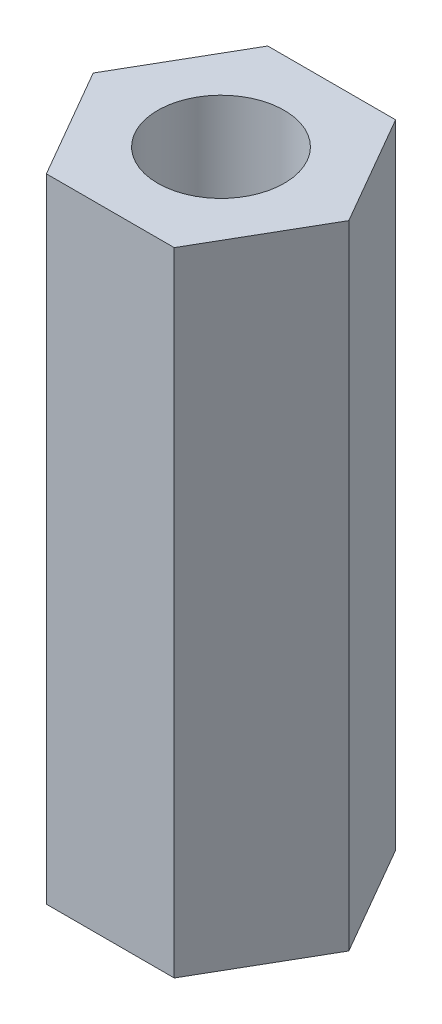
ISO-10303-21;
HEADER;
FILE_DESCRIPTION(('STEP AP214'),'2;1');
FILE_NAME('part.step','',(''),(''),'','','');
FILE_SCHEMA(('AUTOMOTIVE_DESIGN { 1 0 10303 214 1 1 1 1 }'));
ENDSEC;
DATA;
#1=APPLICATION_CONTEXT('core data for automotive mechanical design processes');
#2=APPLICATION_PROTOCOL_DEFINITION('international standard','automotive_design',2000,#1);
#3=PRODUCT_CONTEXT('',#1,'mechanical');
#4=PRODUCT('Part','Part','',(#3));
#5=PRODUCT_RELATED_PRODUCT_CATEGORY('part','',(#4));
#6=PRODUCT_DEFINITION_FORMATION('','',#4);
#7=PRODUCT_DEFINITION_CONTEXT('part definition',#1,'design');
#8=PRODUCT_DEFINITION('design','',#6,#7);
#9=PRODUCT_DEFINITION_SHAPE('','',#8);
#10=(LENGTH_UNIT() NAMED_UNIT(*) SI_UNIT(.MILLI.,.METRE.));
#11=(NAMED_UNIT(*) PLANE_ANGLE_UNIT() SI_UNIT($,.RADIAN.));
#12=(NAMED_UNIT(*) SI_UNIT($,.STERADIAN.) SOLID_ANGLE_UNIT());
#13=UNCERTAINTY_MEASURE_WITH_UNIT(LENGTH_MEASURE(1.E-05),#10,'distance_accuracy_value','');
#14=(GEOMETRIC_REPRESENTATION_CONTEXT(3) GLOBAL_UNCERTAINTY_ASSIGNED_CONTEXT((#13)) GLOBAL_UNIT_ASSIGNED_CONTEXT((#10,
#11,#12)) REPRESENTATION_CONTEXT('',''));
#15=CARTESIAN_POINT('',(0.,0.,0.));
#16=DIRECTION('',(0.,0.,1.));
#17=DIRECTION('',(1.,0.,0.));
#18=AXIS2_PLACEMENT_3D('',#15,#16,#17);
#19=CARTESIAN_POINT('',(0.,20.,0.));
#20=DIRECTION('',(0.,1.,0.));
#21=DIRECTION('',(0.,0.,1.));
#22=AXIS2_PLACEMENT_3D('',#19,#20,#21);
#23=PLANE('',#22);
#24=DIRECTION('',(-0.5,0.,-0.866025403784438));
#25=VECTOR('',#24,1.);
#26=CARTESIAN_POINT('',(4.04145188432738,20.,0.));
#27=LINE('',#26,#25);
#28=CARTESIAN_POINT('',(4.04145188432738,20.,0.));
#29=VERTEX_POINT('',#28);
#30=CARTESIAN_POINT('',(2.02072594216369,20.,-3.5));
#31=VERTEX_POINT('',#30);
#32=EDGE_CURVE('E152',#29,#31,#27,.T.);
#33=ORIENTED_EDGE('',*,*,#32,.T.);
#34=DIRECTION('',(-1.,0.,0.));
#35=VECTOR('',#34,1.);
#36=CARTESIAN_POINT('',(2.02072594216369,20.,-3.5));
#37=LINE('',#36,#35);
#38=CARTESIAN_POINT('',(-2.02072594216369,20.,-3.5));
#39=VERTEX_POINT('',#38);
#40=EDGE_CURVE('E100',#31,#39,#37,.T.);
#41=ORIENTED_EDGE('',*,*,#40,.T.);
#42=DIRECTION('',(-0.5,0.,0.866025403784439));
#43=VECTOR('',#42,1.);
#44=CARTESIAN_POINT('',(-2.02072594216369,20.,-3.5));
#45=LINE('',#44,#43);
#46=CARTESIAN_POINT('',(-4.04145188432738,20.,0.));
#47=VERTEX_POINT('',#46);
#48=EDGE_CURVE('E113',#39,#47,#45,.T.);
#49=ORIENTED_EDGE('',*,*,#48,.T.);
#50=DIRECTION('',(0.5,0.,0.866025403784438));
#51=VECTOR('',#50,1.);
#52=CARTESIAN_POINT('',(-4.04145188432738,20.,0.));
#53=LINE('',#52,#51);
#54=CARTESIAN_POINT('',(-2.02072594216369,20.,3.5));
#55=VERTEX_POINT('',#54);
#56=EDGE_CURVE('E107',#47,#55,#53,.T.);
#57=ORIENTED_EDGE('',*,*,#56,.T.);
#58=DIRECTION('',(1.,0.,0.));
#59=VECTOR('',#58,1.);
#60=CARTESIAN_POINT('',(-2.02072594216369,20.,3.5));
#61=LINE('',#60,#59);
#62=CARTESIAN_POINT('',(2.02072594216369,20.,3.5));
#63=VERTEX_POINT('',#62);
#64=EDGE_CURVE('E111',#55,#63,#61,.T.);
#65=ORIENTED_EDGE('',*,*,#64,.T.);
#66=DIRECTION('',(0.5,0.,-0.866025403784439));
#67=VECTOR('',#66,1.);
#68=CARTESIAN_POINT('',(2.02072594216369,20.,3.5));
#69=LINE('',#68,#67);
#70=EDGE_CURVE('E63',#63,#29,#69,.T.);
#71=ORIENTED_EDGE('',*,*,#70,.T.);
#72=EDGE_LOOP('',(#33,#41,#49,#57,#65,#71));
#73=FACE_BOUND('',#72,.T.);
#74=CARTESIAN_POINT('',(0.,20.,0.));
#75=DIRECTION('',(0.,1.,0.));
#76=DIRECTION('',(0.,0.,1.));
#77=AXIS2_PLACEMENT_3D('',#74,#75,#76);
#78=CIRCLE('',#77,2.);
#79=CARTESIAN_POINT('',(0.,20.,2.));
#80=VERTEX_POINT('',#79);
#81=EDGE_CURVE('E140',#80,#80,#78,.T.);
#82=ORIENTED_EDGE('',*,*,#81,.F.);
#83=EDGE_LOOP('',(#82));
#84=FACE_BOUND('',#83,.T.);
#85=ADVANCED_FACE('F45',(#73,#84),#23,.T.);
#86=CARTESIAN_POINT('',(0.,0.,0.));
#87=DIRECTION('',(0.,1.,0.));
#88=DIRECTION('',(0.,0.,1.));
#89=AXIS2_PLACEMENT_3D('',#86,#87,#88);
#90=PLANE('',#89);
#91=DIRECTION('',(-0.5,0.,-0.866025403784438));
#92=VECTOR('',#91,1.);
#93=CARTESIAN_POINT('',(4.04145188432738,0.,0.));
#94=LINE('',#93,#92);
#95=CARTESIAN_POINT('',(4.04145188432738,0.,0.));
#96=VERTEX_POINT('',#95);
#97=CARTESIAN_POINT('',(2.02072594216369,0.,-3.5));
#98=VERTEX_POINT('',#97);
#99=EDGE_CURVE('E135',#96,#98,#94,.T.);
#100=ORIENTED_EDGE('',*,*,#99,.F.);
#101=DIRECTION('',(0.5,0.,-0.866025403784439));
#102=VECTOR('',#101,1.);
#103=CARTESIAN_POINT('',(2.02072594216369,0.,3.5));
#104=LINE('',#103,#102);
#105=CARTESIAN_POINT('',(2.02072594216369,0.,3.5));
#106=VERTEX_POINT('',#105);
#107=EDGE_CURVE('E92',#106,#96,#104,.T.);
#108=ORIENTED_EDGE('',*,*,#107,.F.);
#109=DIRECTION('',(1.,0.,0.));
#110=VECTOR('',#109,1.);
#111=CARTESIAN_POINT('',(-2.02072594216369,0.,3.5));
#112=LINE('',#111,#110);
#113=CARTESIAN_POINT('',(-2.02072594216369,0.,3.5));
#114=VERTEX_POINT('',#113);
#115=EDGE_CURVE('E86',#114,#106,#112,.T.);
#116=ORIENTED_EDGE('',*,*,#115,.F.);
#117=DIRECTION('',(0.5,0.,0.866025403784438));
#118=VECTOR('',#117,1.);
#119=CARTESIAN_POINT('',(-4.04145188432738,0.,0.));
#120=LINE('',#119,#118);
#121=CARTESIAN_POINT('',(-4.04145188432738,0.,0.));
#122=VERTEX_POINT('',#121);
#123=EDGE_CURVE('E122',#122,#114,#120,.T.);
#124=ORIENTED_EDGE('',*,*,#123,.F.);
#125=DIRECTION('',(-0.5,0.,0.866025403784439));
#126=VECTOR('',#125,1.);
#127=CARTESIAN_POINT('',(-2.02072594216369,0.,-3.5));
#128=LINE('',#127,#126);
#129=CARTESIAN_POINT('',(-2.02072594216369,0.,-3.5));
#130=VERTEX_POINT('',#129);
#131=EDGE_CURVE('E143',#130,#122,#128,.T.);
#132=ORIENTED_EDGE('',*,*,#131,.F.);
#133=DIRECTION('',(-1.,0.,0.));
#134=VECTOR('',#133,1.);
#135=CARTESIAN_POINT('',(2.02072594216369,0.,-3.5));
#136=LINE('',#135,#134);
#137=EDGE_CURVE('E139',#98,#130,#136,.T.);
#138=ORIENTED_EDGE('',*,*,#137,.F.);
#139=EDGE_LOOP('',(#100,#108,#116,#124,#132,#138));
#140=FACE_BOUND('',#139,.T.);
#141=CARTESIAN_POINT('',(0.,0.,0.));
#142=DIRECTION('',(0.,1.,0.));
#143=DIRECTION('',(0.,0.,1.));
#144=AXIS2_PLACEMENT_3D('',#141,#142,#143);
#145=CIRCLE('',#144,2.);
#146=CARTESIAN_POINT('',(0.,0.,2.));
#147=VERTEX_POINT('',#146);
#148=EDGE_CURVE('E249',#147,#147,#145,.T.);
#149=ORIENTED_EDGE('',*,*,#148,.T.);
#150=EDGE_LOOP('',(#149));
#151=FACE_BOUND('',#150,.T.);
#152=ADVANCED_FACE('F165',(#140,#151),#90,.F.);
#153=CARTESIAN_POINT('',(4.04145188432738,20.,0.));
#154=DIRECTION('',(-0.866025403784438,0.,0.5));
#155=DIRECTION('',(0.5,0.,0.866025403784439));
#156=AXIS2_PLACEMENT_3D('',#153,#154,#155);
#157=PLANE('',#156);
#158=ORIENTED_EDGE('',*,*,#99,.T.);
#159=DIRECTION('',(0.,-1.,0.));
#160=VECTOR('',#159,1.);
#161=CARTESIAN_POINT('',(2.02072594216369,20.,-3.5));
#162=LINE('',#161,#160);
#163=EDGE_CURVE('E11',#31,#98,#162,.T.);
#164=ORIENTED_EDGE('',*,*,#163,.F.);
#165=ORIENTED_EDGE('',*,*,#32,.F.);
#166=DIRECTION('',(0.,-1.,0.));
#167=VECTOR('',#166,1.);
#168=CARTESIAN_POINT('',(4.04145188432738,20.,0.));
#169=LINE('',#168,#167);
#170=EDGE_CURVE('E131',#29,#96,#169,.T.);
#171=ORIENTED_EDGE('',*,*,#170,.T.);
#172=EDGE_LOOP('',(#158,#164,#165,#171));
#173=FACE_BOUND('',#172,.T.);
#174=ADVANCED_FACE('F47',(#173),#157,.F.);
#175=CARTESIAN_POINT('',(2.02072594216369,20.,-3.5));
#176=DIRECTION('',(0.,0.,1.));
#177=DIRECTION('',(1.,0.,0.));
#178=AXIS2_PLACEMENT_3D('',#175,#176,#177);
#179=PLANE('',#178);
#180=ORIENTED_EDGE('',*,*,#137,.T.);
#181=DIRECTION('',(0.,-1.,0.));
#182=VECTOR('',#181,1.);
#183=CARTESIAN_POINT('',(-2.02072594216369,20.,-3.5));
#184=LINE('',#183,#182);
#185=EDGE_CURVE('E55',#39,#130,#184,.T.);
#186=ORIENTED_EDGE('',*,*,#185,.F.);
#187=ORIENTED_EDGE('',*,*,#40,.F.);
#188=ORIENTED_EDGE('',*,*,#163,.T.);
#189=EDGE_LOOP('',(#180,#186,#187,#188));
#190=FACE_BOUND('',#189,.T.);
#191=ADVANCED_FACE('F190',(#190),#179,.F.);
#192=CARTESIAN_POINT('',(-2.02072594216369,20.,-3.5));
#193=DIRECTION('',(0.866025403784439,0.,0.5));
#194=DIRECTION('',(0.5,0.,-0.866025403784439));
#195=AXIS2_PLACEMENT_3D('',#192,#193,#194);
#196=PLANE('',#195);
#197=ORIENTED_EDGE('',*,*,#131,.T.);
#198=DIRECTION('',(0.,-1.,0.));
#199=VECTOR('',#198,1.);
#200=CARTESIAN_POINT('',(-4.04145188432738,20.,0.));
#201=LINE('',#200,#199);
#202=EDGE_CURVE('E124',#47,#122,#201,.T.);
#203=ORIENTED_EDGE('',*,*,#202,.F.);
#204=ORIENTED_EDGE('',*,*,#48,.F.);
#205=ORIENTED_EDGE('',*,*,#185,.T.);
#206=EDGE_LOOP('',(#197,#203,#204,#205));
#207=FACE_BOUND('',#206,.T.);
#208=ADVANCED_FACE('F162',(#207),#196,.F.);
#209=CARTESIAN_POINT('',(-4.04145188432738,20.,0.));
#210=DIRECTION('',(0.866025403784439,0.,-0.5));
#211=DIRECTION('',(-0.5,0.,-0.866025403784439));
#212=AXIS2_PLACEMENT_3D('',#209,#210,#211);
#213=PLANE('',#212);
#214=ORIENTED_EDGE('',*,*,#123,.T.);
#215=DIRECTION('',(0.,-1.,0.));
#216=VECTOR('',#215,1.);
#217=CARTESIAN_POINT('',(-2.02072594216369,20.,3.5));
#218=LINE('',#217,#216);
#219=EDGE_CURVE('E119',#55,#114,#218,.T.);
#220=ORIENTED_EDGE('',*,*,#219,.F.);
#221=ORIENTED_EDGE('',*,*,#56,.F.);
#222=ORIENTED_EDGE('',*,*,#202,.T.);
#223=EDGE_LOOP('',(#214,#220,#221,#222));
#224=FACE_BOUND('',#223,.T.);
#225=ADVANCED_FACE('F120',(#224),#213,.F.);
#226=CARTESIAN_POINT('',(-2.02072594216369,20.,3.5));
#227=DIRECTION('',(0.,0.,-1.));
#228=DIRECTION('',(-1.,0.,0.));
#229=AXIS2_PLACEMENT_3D('',#226,#227,#228);
#230=PLANE('',#229);
#231=ORIENTED_EDGE('',*,*,#115,.T.);
#232=DIRECTION('',(0.,-1.,0.));
#233=VECTOR('',#232,1.);
#234=CARTESIAN_POINT('',(2.02072594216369,20.,3.5));
#235=LINE('',#234,#233);
#236=EDGE_CURVE('E125',#63,#106,#235,.T.);
#237=ORIENTED_EDGE('',*,*,#236,.F.);
#238=ORIENTED_EDGE('',*,*,#64,.F.);
#239=ORIENTED_EDGE('',*,*,#219,.T.);
#240=EDGE_LOOP('',(#231,#237,#238,#239));
#241=FACE_BOUND('',#240,.T.);
#242=ADVANCED_FACE('F127',(#241),#230,.F.);
#243=CARTESIAN_POINT('',(2.02072594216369,20.,3.5));
#244=DIRECTION('',(-0.866025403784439,0.,-0.5));
#245=DIRECTION('',(-0.5,0.,0.866025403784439));
#246=AXIS2_PLACEMENT_3D('',#243,#244,#245);
#247=PLANE('',#246);
#248=ORIENTED_EDGE('',*,*,#107,.T.);
#249=ORIENTED_EDGE('',*,*,#170,.F.);
#250=ORIENTED_EDGE('',*,*,#70,.F.);
#251=ORIENTED_EDGE('',*,*,#236,.T.);
#252=EDGE_LOOP('',(#248,#249,#250,#251));
#253=FACE_BOUND('',#252,.T.);
#254=ADVANCED_FACE('F170',(#253),#247,.F.);
#255=CARTESIAN_POINT('',(0.,20.,0.));
#256=DIRECTION('',(0.,-1.,0.));
#257=DIRECTION('',(0.,0.,-1.));
#258=AXIS2_PLACEMENT_3D('',#255,#256,#257);
#259=CYLINDRICAL_SURFACE('',#258,2.);
#260=ORIENTED_EDGE('',*,*,#81,.T.);
#261=EDGE_LOOP('',(#260));
#262=FACE_BOUND('',#261,.T.);
#263=ORIENTED_EDGE('',*,*,#148,.F.);
#264=EDGE_LOOP('',(#263));
#265=FACE_BOUND('',#264,.T.);
#266=ADVANCED_FACE('F172',(#262,#265),#259,.F.);
#267=CLOSED_SHELL('',(#85,#152,#174,#191,#208,#225,#242,#254,#266));
#268=MANIFOLD_SOLID_BREP('B2',#267);
#269=ADVANCED_BREP_SHAPE_REPRESENTATION('',(#18,#268),#14);
#270=SHAPE_DEFINITION_REPRESENTATION(#9,#269);
ENDSEC;
END-ISO-10303-21;
